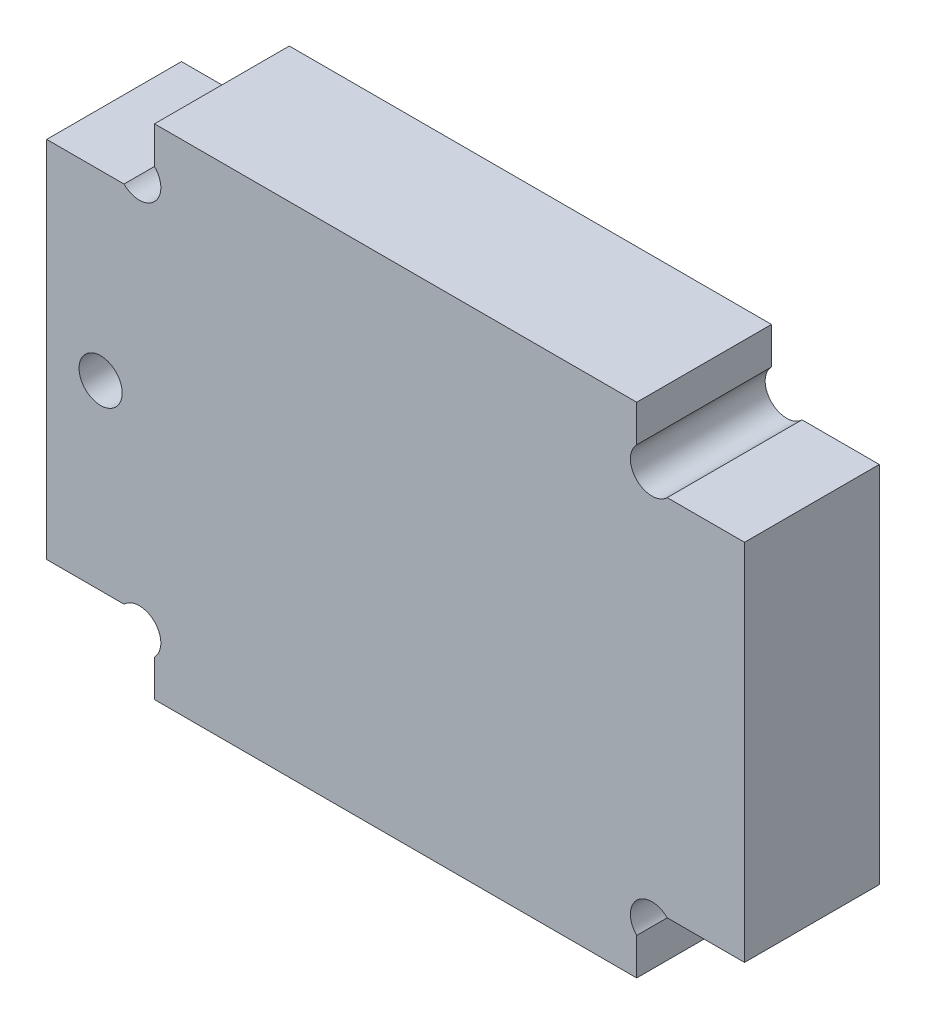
ISO-10303-21;
HEADER;
FILE_DESCRIPTION(('STEP AP214'),'2;1');
FILE_NAME('part.step','',(''),(''),'','','');
FILE_SCHEMA(('AUTOMOTIVE_DESIGN { 1 0 10303 214 1 1 1 1 }'));
ENDSEC;
DATA;
#1=APPLICATION_CONTEXT('core data for automotive mechanical design processes');
#2=APPLICATION_PROTOCOL_DEFINITION('international standard','automotive_design',2000,#1);
#3=PRODUCT_CONTEXT('',#1,'mechanical');
#4=PRODUCT('Part','Part','',(#3));
#5=PRODUCT_RELATED_PRODUCT_CATEGORY('part','',(#4));
#6=PRODUCT_DEFINITION_FORMATION('','',#4);
#7=PRODUCT_DEFINITION_CONTEXT('part definition',#1,'design');
#8=PRODUCT_DEFINITION('design','',#6,#7);
#9=PRODUCT_DEFINITION_SHAPE('','',#8);
#10=(LENGTH_UNIT() NAMED_UNIT(*) SI_UNIT(.MILLI.,.METRE.));
#11=(NAMED_UNIT(*) PLANE_ANGLE_UNIT() SI_UNIT($,.RADIAN.));
#12=(NAMED_UNIT(*) SI_UNIT($,.STERADIAN.) SOLID_ANGLE_UNIT());
#13=UNCERTAINTY_MEASURE_WITH_UNIT(LENGTH_MEASURE(1.E-05),#10,'distance_accuracy_value','');
#14=(GEOMETRIC_REPRESENTATION_CONTEXT(3) GLOBAL_UNCERTAINTY_ASSIGNED_CONTEXT((#13)) GLOBAL_UNIT_ASSIGNED_CONTEXT((#10,
#11,#12)) REPRESENTATION_CONTEXT('',''));
#15=CARTESIAN_POINT('',(0.,0.,0.));
#16=DIRECTION('',(0.,0.,1.));
#17=DIRECTION('',(1.,0.,0.));
#18=AXIS2_PLACEMENT_3D('',#15,#16,#17);
#19=CARTESIAN_POINT('',(-17.89,18.5,10.));
#20=DIRECTION('',(1.,0.,0.));
#21=DIRECTION('',(0.,1.,0.));
#22=AXIS2_PLACEMENT_3D('',#19,#20,#21);
#23=PLANE('',#22);
#24=DIRECTION('',(0.,-1.,0.));
#25=VECTOR('',#24,1.);
#26=CARTESIAN_POINT('',(-17.89,18.5,0.));
#27=LINE('',#26,#25);
#28=CARTESIAN_POINT('',(-17.89,18.5,0.));
#29=VERTEX_POINT('',#28);
#30=CARTESIAN_POINT('',(-17.89,15.762741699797,0.));
#31=VERTEX_POINT('',#30);
#32=EDGE_CURVE('E225',#29,#31,#27,.T.);
#33=ORIENTED_EDGE('',*,*,#32,.T.);
#34=DIRECTION('',(0.,0.,1.));
#35=VECTOR('',#34,1.);
#36=CARTESIAN_POINT('',(-17.89,15.762741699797,0.));
#37=LINE('',#36,#35);
#38=CARTESIAN_POINT('',(-17.89,15.762741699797,10.));
#39=VERTEX_POINT('',#38);
#40=EDGE_CURVE('E252',#31,#39,#37,.T.);
#41=ORIENTED_EDGE('',*,*,#40,.T.);
#42=DIRECTION('',(0.,-1.,0.));
#43=VECTOR('',#42,1.);
#44=CARTESIAN_POINT('',(-17.89,18.5,10.));
#45=LINE('',#44,#43);
#46=CARTESIAN_POINT('',(-17.89,18.5,10.));
#47=VERTEX_POINT('',#46);
#48=EDGE_CURVE('E231',#47,#39,#45,.T.);
#49=ORIENTED_EDGE('',*,*,#48,.F.);
#50=DIRECTION('',(0.,0.,-1.));
#51=VECTOR('',#50,1.);
#52=CARTESIAN_POINT('',(-17.89,18.5,10.));
#53=LINE('',#52,#51);
#54=EDGE_CURVE('E221',#47,#29,#53,.T.);
#55=ORIENTED_EDGE('',*,*,#54,.T.);
#56=EDGE_LOOP('',(#33,#41,#49,#55));
#57=FACE_BOUND('',#56,.T.);
#58=ADVANCED_FACE('F33',(#57),#23,.F.);
#59=CARTESIAN_POINT('',(-17.89,-15.762741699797,10.));
#60=VERTEX_POINT('',#59);
#61=CARTESIAN_POINT('',(-17.89,-18.5,10.));
#62=VERTEX_POINT('',#61);
#63=EDGE_CURVE('E36',#60,#62,#45,.T.);
#64=ORIENTED_EDGE('',*,*,#63,.F.);
#65=DIRECTION('',(0.,0.,1.));
#66=VECTOR('',#65,1.);
#67=CARTESIAN_POINT('',(-17.89,-15.762741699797,0.));
#68=LINE('',#67,#66);
#69=CARTESIAN_POINT('',(-17.89,-15.762741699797,0.));
#70=VERTEX_POINT('',#69);
#71=EDGE_CURVE('E154',#70,#60,#68,.T.);
#72=ORIENTED_EDGE('',*,*,#71,.F.);
#73=CARTESIAN_POINT('',(-17.89,-18.5,0.));
#74=VERTEX_POINT('',#73);
#75=EDGE_CURVE('E163',#70,#74,#27,.T.);
#76=ORIENTED_EDGE('',*,*,#75,.T.);
#77=DIRECTION('',(0.,0.,-1.));
#78=VECTOR('',#77,1.);
#79=CARTESIAN_POINT('',(-17.89,-18.5,10.));
#80=LINE('',#79,#78);
#81=EDGE_CURVE('E11',#62,#74,#80,.T.);
#82=ORIENTED_EDGE('',*,*,#81,.F.);
#83=EDGE_LOOP('',(#64,#72,#76,#82));
#84=FACE_BOUND('',#83,.T.);
#85=ADVANCED_FACE('F325',(#84),#23,.F.);
#86=CARTESIAN_POINT('',(17.89,18.5,10.));
#87=DIRECTION('',(1.,0.,0.));
#88=DIRECTION('',(0.,1.,0.));
#89=AXIS2_PLACEMENT_3D('',#86,#87,#88);
#90=PLANE('',#89);
#91=DIRECTION('',(0.,0.,1.));
#92=VECTOR('',#91,1.);
#93=CARTESIAN_POINT('',(17.89,15.762741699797,0.));
#94=LINE('',#93,#92);
#95=CARTESIAN_POINT('',(17.89,15.762741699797,0.));
#96=VERTEX_POINT('',#95);
#97=CARTESIAN_POINT('',(17.89,15.762741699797,10.));
#98=VERTEX_POINT('',#97);
#99=EDGE_CURVE('E518',#96,#98,#94,.T.);
#100=ORIENTED_EDGE('',*,*,#99,.F.);
#101=DIRECTION('',(0.,-1.,0.));
#102=VECTOR('',#101,1.);
#103=CARTESIAN_POINT('',(17.89,18.5,0.));
#104=LINE('',#103,#102);
#105=CARTESIAN_POINT('',(17.89,18.5,0.));
#106=VERTEX_POINT('',#105);
#107=EDGE_CURVE('E194',#106,#96,#104,.T.);
#108=ORIENTED_EDGE('',*,*,#107,.F.);
#109=DIRECTION('',(0.,0.,-1.));
#110=VECTOR('',#109,1.);
#111=CARTESIAN_POINT('',(17.89,18.5,10.));
#112=LINE('',#111,#110);
#113=CARTESIAN_POINT('',(17.89,18.5,10.));
#114=VERTEX_POINT('',#113);
#115=EDGE_CURVE('E278',#114,#106,#112,.T.);
#116=ORIENTED_EDGE('',*,*,#115,.F.);
#117=DIRECTION('',(0.,-1.,0.));
#118=VECTOR('',#117,1.);
#119=CARTESIAN_POINT('',(17.89,18.5,10.));
#120=LINE('',#119,#118);
#121=EDGE_CURVE('E209',#114,#98,#120,.T.);
#122=ORIENTED_EDGE('',*,*,#121,.T.);
#123=EDGE_LOOP('',(#100,#108,#116,#122));
#124=FACE_BOUND('',#123,.T.);
#125=ADVANCED_FACE('F348',(#124),#90,.T.);
#126=CARTESIAN_POINT('',(-17.89,-18.5,10.));
#127=DIRECTION('',(0.,1.,0.));
#128=DIRECTION('',(0.,0.,1.));
#129=AXIS2_PLACEMENT_3D('',#126,#127,#128);
#130=PLANE('',#129);
#131=DIRECTION('',(1.,0.,0.));
#132=VECTOR('',#131,1.);
#133=CARTESIAN_POINT('',(-17.89,-18.5,0.));
#134=LINE('',#133,#132);
#135=CARTESIAN_POINT('',(17.89,-18.5,0.));
#136=VERTEX_POINT('',#135);
#137=EDGE_CURVE('E195',#74,#136,#134,.T.);
#138=ORIENTED_EDGE('',*,*,#137,.T.);
#139=DIRECTION('',(0.,0.,-1.));
#140=VECTOR('',#139,1.);
#141=CARTESIAN_POINT('',(17.89,-18.5,10.));
#142=LINE('',#141,#140);
#143=CARTESIAN_POINT('',(17.89,-18.5,10.));
#144=VERTEX_POINT('',#143);
#145=EDGE_CURVE('E42',#144,#136,#142,.T.);
#146=ORIENTED_EDGE('',*,*,#145,.F.);
#147=DIRECTION('',(1.,0.,0.));
#148=VECTOR('',#147,1.);
#149=CARTESIAN_POINT('',(-17.89,-18.5,10.));
#150=LINE('',#149,#148);
#151=EDGE_CURVE('E218',#62,#144,#150,.T.);
#152=ORIENTED_EDGE('',*,*,#151,.F.);
#153=ORIENTED_EDGE('',*,*,#81,.T.);
#154=EDGE_LOOP('',(#138,#146,#152,#153));
#155=FACE_BOUND('',#154,.T.);
#156=ADVANCED_FACE('F293',(#155),#130,.F.);
#157=DIRECTION('',(0.,0.,1.));
#158=VECTOR('',#157,1.);
#159=CARTESIAN_POINT('',(17.89,-15.762741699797,0.));
#160=LINE('',#159,#158);
#161=CARTESIAN_POINT('',(17.89,-15.762741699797,0.));
#162=VERTEX_POINT('',#161);
#163=CARTESIAN_POINT('',(17.89,-15.762741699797,10.));
#164=VERTEX_POINT('',#163);
#165=EDGE_CURVE('E298',#162,#164,#160,.T.);
#166=ORIENTED_EDGE('',*,*,#165,.T.);
#167=EDGE_CURVE('E196',#164,#144,#120,.T.);
#168=ORIENTED_EDGE('',*,*,#167,.T.);
#169=ORIENTED_EDGE('',*,*,#145,.T.);
#170=EDGE_CURVE('E191',#162,#136,#104,.T.);
#171=ORIENTED_EDGE('',*,*,#170,.F.);
#172=EDGE_LOOP('',(#166,#168,#169,#171));
#173=FACE_BOUND('',#172,.T.);
#174=ADVANCED_FACE('F288',(#173),#90,.T.);
#175=CARTESIAN_POINT('',(-17.89,18.5,10.));
#176=DIRECTION('',(0.,1.,0.));
#177=DIRECTION('',(0.,0.,1.));
#178=AXIS2_PLACEMENT_3D('',#175,#176,#177);
#179=PLANE('',#178);
#180=DIRECTION('',(1.,0.,0.));
#181=VECTOR('',#180,1.);
#182=CARTESIAN_POINT('',(-17.89,18.5,0.));
#183=LINE('',#182,#181);
#184=EDGE_CURVE('E202',#29,#106,#183,.T.);
#185=ORIENTED_EDGE('',*,*,#184,.F.);
#186=ORIENTED_EDGE('',*,*,#54,.F.);
#187=DIRECTION('',(1.,0.,0.));
#188=VECTOR('',#187,1.);
#189=CARTESIAN_POINT('',(-17.89,18.5,10.));
#190=LINE('',#189,#188);
#191=EDGE_CURVE('E212',#47,#114,#190,.T.);
#192=ORIENTED_EDGE('',*,*,#191,.T.);
#193=ORIENTED_EDGE('',*,*,#115,.T.);
#194=EDGE_LOOP('',(#185,#186,#192,#193));
#195=FACE_BOUND('',#194,.T.);
#196=ADVANCED_FACE('F277',(#195),#179,.T.);
#197=CARTESIAN_POINT('',(0.,0.,10.));
#198=DIRECTION('',(0.,0.,1.));
#199=DIRECTION('',(1.,0.,0.));
#200=AXIS2_PLACEMENT_3D('',#197,#198,#199);
#201=PLANE('',#200);
#202=CARTESIAN_POINT('',(-21.89,0.,10.));
#203=DIRECTION('',(0.,0.,1.));
#204=DIRECTION('',(1.,0.,0.));
#205=AXIS2_PLACEMENT_3D('',#202,#203,#204);
#206=CIRCLE('',#205,1.6);
#207=CARTESIAN_POINT('',(-20.29,0.,10.));
#208=VERTEX_POINT('',#207);
#209=EDGE_CURVE('E317',#208,#208,#206,.T.);
#210=ORIENTED_EDGE('',*,*,#209,.F.);
#211=EDGE_LOOP('',(#210));
#212=FACE_BOUND('',#211,.T.);
#213=DIRECTION('',(1.,0.,0.));
#214=VECTOR('',#213,1.);
#215=CARTESIAN_POINT('',(-25.89,-13.5,10.));
#216=LINE('',#215,#214);
#217=CARTESIAN_POINT('',(-25.89,-13.5,10.));
#218=VERTEX_POINT('',#217);
#219=CARTESIAN_POINT('',(-20.1527416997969,-13.5,10.));
#220=VERTEX_POINT('',#219);
#221=EDGE_CURVE('E169',#218,#220,#216,.T.);
#222=ORIENTED_EDGE('',*,*,#221,.T.);
#223=CARTESIAN_POINT('',(-19.0213708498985,-14.6313708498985,10.));
#224=DIRECTION('',(0.,0.,1.));
#225=DIRECTION('',(1.,0.,0.));
#226=AXIS2_PLACEMENT_3D('',#223,#224,#225);
#227=CIRCLE('',#226,1.6);
#228=EDGE_CURVE('E50',#60,#220,#227,.T.);
#229=ORIENTED_EDGE('',*,*,#228,.F.);
#230=ORIENTED_EDGE('',*,*,#63,.T.);
#231=ORIENTED_EDGE('',*,*,#151,.T.);
#232=ORIENTED_EDGE('',*,*,#167,.F.);
#233=CARTESIAN_POINT('',(19.0213708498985,-14.6313708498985,10.));
#234=DIRECTION('',(0.,0.,1.));
#235=DIRECTION('',(-1.,0.,0.));
#236=AXIS2_PLACEMENT_3D('',#233,#234,#235);
#237=CIRCLE('',#236,1.59999999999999);
#238=CARTESIAN_POINT('',(20.1527416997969,-13.5,10.));
#239=VERTEX_POINT('',#238);
#240=EDGE_CURVE('E299',#239,#164,#237,.T.);
#241=ORIENTED_EDGE('',*,*,#240,.F.);
#242=DIRECTION('',(-1.,0.,0.));
#243=VECTOR('',#242,1.);
#244=CARTESIAN_POINT('',(25.89,-13.5,10.));
#245=LINE('',#244,#243);
#246=CARTESIAN_POINT('',(25.89,-13.5,10.));
#247=VERTEX_POINT('',#246);
#248=EDGE_CURVE('E534',#247,#239,#245,.T.);
#249=ORIENTED_EDGE('',*,*,#248,.F.);
#250=DIRECTION('',(0.,-1.,0.));
#251=VECTOR('',#250,1.);
#252=CARTESIAN_POINT('',(25.89,13.5,10.));
#253=LINE('',#252,#251);
#254=CARTESIAN_POINT('',(25.89,13.5,10.));
#255=VERTEX_POINT('',#254);
#256=EDGE_CURVE('E168',#255,#247,#253,.T.);
#257=ORIENTED_EDGE('',*,*,#256,.F.);
#258=DIRECTION('',(-1.,0.,0.));
#259=VECTOR('',#258,1.);
#260=CARTESIAN_POINT('',(25.89,13.5,10.));
#261=LINE('',#260,#259);
#262=CARTESIAN_POINT('',(20.1527416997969,13.5,10.));
#263=VERTEX_POINT('',#262);
#264=EDGE_CURVE('E238',#255,#263,#261,.T.);
#265=ORIENTED_EDGE('',*,*,#264,.T.);
#266=CARTESIAN_POINT('',(19.0213708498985,14.6313708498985,10.));
#267=DIRECTION('',(0.,0.,1.));
#268=DIRECTION('',(1.,0.,0.));
#269=AXIS2_PLACEMENT_3D('',#266,#267,#268);
#270=CIRCLE('',#269,1.6);
#271=EDGE_CURVE('E305',#98,#263,#270,.T.);
#272=ORIENTED_EDGE('',*,*,#271,.F.);
#273=ORIENTED_EDGE('',*,*,#121,.F.);
#274=ORIENTED_EDGE('',*,*,#191,.F.);
#275=ORIENTED_EDGE('',*,*,#48,.T.);
#276=CARTESIAN_POINT('',(-19.0213708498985,14.6313708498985,10.));
#277=DIRECTION('',(0.,0.,1.));
#278=DIRECTION('',(-1.,0.,0.));
#279=AXIS2_PLACEMENT_3D('',#276,#277,#278);
#280=CIRCLE('',#279,1.6);
#281=CARTESIAN_POINT('',(-20.1527416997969,13.5,10.));
#282=VERTEX_POINT('',#281);
#283=EDGE_CURVE('E253',#282,#39,#280,.T.);
#284=ORIENTED_EDGE('',*,*,#283,.F.);
#285=DIRECTION('',(1.,0.,0.));
#286=VECTOR('',#285,1.);
#287=CARTESIAN_POINT('',(-25.89,13.5,10.));
#288=LINE('',#287,#286);
#289=CARTESIAN_POINT('',(-25.89,13.5,10.));
#290=VERTEX_POINT('',#289);
#291=EDGE_CURVE('E174',#290,#282,#288,.T.);
#292=ORIENTED_EDGE('',*,*,#291,.F.);
#293=DIRECTION('',(0.,1.,0.));
#294=VECTOR('',#293,1.);
#295=CARTESIAN_POINT('',(-25.89,13.5,10.));
#296=LINE('',#295,#294);
#297=EDGE_CURVE('E243',#218,#290,#296,.T.);
#298=ORIENTED_EDGE('',*,*,#297,.F.);
#299=EDGE_LOOP('',(#222,#229,#230,#231,#232,#241,#249,#257,#265,#272,#273,#274,#275,#284,#292,#298));
#300=FACE_BOUND('',#299,.T.);
#301=ADVANCED_FACE('F272',(#212,#300),#201,.T.);
#302=CARTESIAN_POINT('',(0.,0.,0.));
#303=DIRECTION('',(0.,0.,1.));
#304=DIRECTION('',(1.,0.,0.));
#305=AXIS2_PLACEMENT_3D('',#302,#303,#304);
#306=PLANE('',#305);
#307=CARTESIAN_POINT('',(-21.89,0.,0.));
#308=DIRECTION('',(0.,0.,1.));
#309=DIRECTION('',(1.,0.,0.));
#310=AXIS2_PLACEMENT_3D('',#307,#308,#309);
#311=CIRCLE('',#310,1.6);
#312=CARTESIAN_POINT('',(-20.29,0.,0.));
#313=VERTEX_POINT('',#312);
#314=EDGE_CURVE('E324',#313,#313,#311,.T.);
#315=ORIENTED_EDGE('',*,*,#314,.T.);
#316=EDGE_LOOP('',(#315));
#317=FACE_BOUND('',#316,.T.);
#318=ORIENTED_EDGE('',*,*,#75,.F.);
#319=CARTESIAN_POINT('',(-19.0213708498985,-14.6313708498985,0.));
#320=DIRECTION('',(0.,0.,1.));
#321=DIRECTION('',(1.,0.,0.));
#322=AXIS2_PLACEMENT_3D('',#319,#320,#321);
#323=CIRCLE('',#322,1.6);
#324=CARTESIAN_POINT('',(-20.1527416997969,-13.5,0.));
#325=VERTEX_POINT('',#324);
#326=EDGE_CURVE('E148',#70,#325,#323,.T.);
#327=ORIENTED_EDGE('',*,*,#326,.T.);
#328=DIRECTION('',(1.,0.,0.));
#329=VECTOR('',#328,1.);
#330=CARTESIAN_POINT('',(-25.89,-13.5,0.));
#331=LINE('',#330,#329);
#332=CARTESIAN_POINT('',(-25.89,-13.5,0.));
#333=VERTEX_POINT('',#332);
#334=EDGE_CURVE('E161',#333,#325,#331,.T.);
#335=ORIENTED_EDGE('',*,*,#334,.F.);
#336=DIRECTION('',(0.,-1.,0.));
#337=VECTOR('',#336,1.);
#338=CARTESIAN_POINT('',(-25.89,13.5,0.));
#339=LINE('',#338,#337);
#340=CARTESIAN_POINT('',(-25.89,13.5,0.));
#341=VERTEX_POINT('',#340);
#342=EDGE_CURVE('E246',#341,#333,#339,.T.);
#343=ORIENTED_EDGE('',*,*,#342,.F.);
#344=DIRECTION('',(1.,0.,0.));
#345=VECTOR('',#344,1.);
#346=CARTESIAN_POINT('',(-25.89,13.5,0.));
#347=LINE('',#346,#345);
#348=CARTESIAN_POINT('',(-20.1527416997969,13.5,0.));
#349=VERTEX_POINT('',#348);
#350=EDGE_CURVE('E181',#341,#349,#347,.T.);
#351=ORIENTED_EDGE('',*,*,#350,.T.);
#352=CARTESIAN_POINT('',(-19.0213708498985,14.6313708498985,0.));
#353=DIRECTION('',(0.,0.,1.));
#354=DIRECTION('',(-1.,0.,0.));
#355=AXIS2_PLACEMENT_3D('',#352,#353,#354);
#356=CIRCLE('',#355,1.6);
#357=EDGE_CURVE('E249',#349,#31,#356,.T.);
#358=ORIENTED_EDGE('',*,*,#357,.T.);
#359=ORIENTED_EDGE('',*,*,#32,.F.);
#360=ORIENTED_EDGE('',*,*,#184,.T.);
#361=ORIENTED_EDGE('',*,*,#107,.T.);
#362=CARTESIAN_POINT('',(19.0213708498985,14.6313708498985,0.));
#363=DIRECTION('',(0.,0.,1.));
#364=DIRECTION('',(1.,0.,0.));
#365=AXIS2_PLACEMENT_3D('',#362,#363,#364);
#366=CIRCLE('',#365,1.6);
#367=CARTESIAN_POINT('',(20.1527416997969,13.5,0.));
#368=VERTEX_POINT('',#367);
#369=EDGE_CURVE('E258',#96,#368,#366,.T.);
#370=ORIENTED_EDGE('',*,*,#369,.T.);
#371=DIRECTION('',(-1.,0.,0.));
#372=VECTOR('',#371,1.);
#373=CARTESIAN_POINT('',(25.89,13.5,0.));
#374=LINE('',#373,#372);
#375=CARTESIAN_POINT('',(25.89,13.5,0.));
#376=VERTEX_POINT('',#375);
#377=EDGE_CURVE('E525',#376,#368,#374,.T.);
#378=ORIENTED_EDGE('',*,*,#377,.F.);
#379=DIRECTION('',(0.,1.,0.));
#380=VECTOR('',#379,1.);
#381=CARTESIAN_POINT('',(25.89,13.5,0.));
#382=LINE('',#381,#380);
#383=CARTESIAN_POINT('',(25.89,-13.5,0.));
#384=VERTEX_POINT('',#383);
#385=EDGE_CURVE('E239',#384,#376,#382,.T.);
#386=ORIENTED_EDGE('',*,*,#385,.F.);
#387=DIRECTION('',(-1.,0.,0.));
#388=VECTOR('',#387,1.);
#389=CARTESIAN_POINT('',(25.89,-13.5,0.));
#390=LINE('',#389,#388);
#391=CARTESIAN_POINT('',(20.1527416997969,-13.5,0.));
#392=VERTEX_POINT('',#391);
#393=EDGE_CURVE('E213',#384,#392,#390,.T.);
#394=ORIENTED_EDGE('',*,*,#393,.T.);
#395=CARTESIAN_POINT('',(19.0213708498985,-14.6313708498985,0.));
#396=DIRECTION('',(0.,0.,1.));
#397=DIRECTION('',(-1.,0.,0.));
#398=AXIS2_PLACEMENT_3D('',#395,#396,#397);
#399=CIRCLE('',#398,1.59999999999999);
#400=EDGE_CURVE('E58',#392,#162,#399,.T.);
#401=ORIENTED_EDGE('',*,*,#400,.T.);
#402=ORIENTED_EDGE('',*,*,#170,.T.);
#403=ORIENTED_EDGE('',*,*,#137,.F.);
#404=EDGE_LOOP('',(#318,#327,#335,#343,#351,#358,#359,#360,#361,#370,#378,#386,#394,#401,#402,#403));
#405=FACE_BOUND('',#404,.T.);
#406=ADVANCED_FACE('F159',(#317,#405),#306,.F.);
#407=CARTESIAN_POINT('',(25.89,-13.5,10.));
#408=DIRECTION('',(0.,1.,0.));
#409=DIRECTION('',(0.,0.,1.));
#410=AXIS2_PLACEMENT_3D('',#407,#408,#409);
#411=PLANE('',#410);
#412=ORIENTED_EDGE('',*,*,#248,.T.);
#413=DIRECTION('',(0.,0.,1.));
#414=VECTOR('',#413,1.);
#415=CARTESIAN_POINT('',(20.1527416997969,-13.5,0.));
#416=LINE('',#415,#414);
#417=EDGE_CURVE('E303',#392,#239,#416,.T.);
#418=ORIENTED_EDGE('',*,*,#417,.F.);
#419=ORIENTED_EDGE('',*,*,#393,.F.);
#420=DIRECTION('',(0.,0.,-1.));
#421=VECTOR('',#420,1.);
#422=CARTESIAN_POINT('',(25.89,-13.5,10.));
#423=LINE('',#422,#421);
#424=EDGE_CURVE('E172',#247,#384,#423,.T.);
#425=ORIENTED_EDGE('',*,*,#424,.F.);
#426=EDGE_LOOP('',(#412,#418,#419,#425));
#427=FACE_BOUND('',#426,.T.);
#428=ADVANCED_FACE('F371',(#427),#411,.F.);
#429=CARTESIAN_POINT('',(25.89,13.5,10.));
#430=DIRECTION('',(0.,-1.,0.));
#431=DIRECTION('',(1.,0.,0.));
#432=AXIS2_PLACEMENT_3D('',#429,#430,#431);
#433=PLANE('',#432);
#434=ORIENTED_EDGE('',*,*,#377,.T.);
#435=DIRECTION('',(0.,0.,1.));
#436=VECTOR('',#435,1.);
#437=CARTESIAN_POINT('',(20.1527416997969,13.5,0.));
#438=LINE('',#437,#436);
#439=EDGE_CURVE('E517',#368,#263,#438,.T.);
#440=ORIENTED_EDGE('',*,*,#439,.T.);
#441=ORIENTED_EDGE('',*,*,#264,.F.);
#442=DIRECTION('',(0.,0.,1.));
#443=VECTOR('',#442,1.);
#444=CARTESIAN_POINT('',(25.89,13.5,10.));
#445=LINE('',#444,#443);
#446=EDGE_CURVE('E235',#376,#255,#445,.T.);
#447=ORIENTED_EDGE('',*,*,#446,.F.);
#448=EDGE_LOOP('',(#434,#440,#441,#447));
#449=FACE_BOUND('',#448,.T.);
#450=ADVANCED_FACE('F376',(#449),#433,.F.);
#451=CARTESIAN_POINT('',(25.89,0.,0.));
#452=DIRECTION('',(1.,0.,0.));
#453=DIRECTION('',(0.,1.,0.));
#454=AXIS2_PLACEMENT_3D('',#451,#452,#453);
#455=PLANE('',#454);
#456=ORIENTED_EDGE('',*,*,#256,.T.);
#457=ORIENTED_EDGE('',*,*,#424,.T.);
#458=ORIENTED_EDGE('',*,*,#385,.T.);
#459=ORIENTED_EDGE('',*,*,#446,.T.);
#460=EDGE_LOOP('',(#456,#457,#458,#459));
#461=FACE_BOUND('',#460,.T.);
#462=ADVANCED_FACE('F380',(#461),#455,.T.);
#463=CARTESIAN_POINT('',(-25.89,-13.5,0.));
#464=DIRECTION('',(0.,1.,0.));
#465=DIRECTION('',(0.,0.,1.));
#466=AXIS2_PLACEMENT_3D('',#463,#464,#465);
#467=PLANE('',#466);
#468=ORIENTED_EDGE('',*,*,#334,.T.);
#469=DIRECTION('',(0.,0.,1.));
#470=VECTOR('',#469,1.);
#471=CARTESIAN_POINT('',(-20.1527416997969,-13.5,0.));
#472=LINE('',#471,#470);
#473=EDGE_CURVE('E145',#325,#220,#472,.T.);
#474=ORIENTED_EDGE('',*,*,#473,.T.);
#475=ORIENTED_EDGE('',*,*,#221,.F.);
#476=DIRECTION('',(0.,0.,1.));
#477=VECTOR('',#476,1.);
#478=CARTESIAN_POINT('',(-25.89,-13.5,0.));
#479=LINE('',#478,#477);
#480=EDGE_CURVE('E166',#333,#218,#479,.T.);
#481=ORIENTED_EDGE('',*,*,#480,.F.);
#482=EDGE_LOOP('',(#468,#474,#475,#481));
#483=FACE_BOUND('',#482,.T.);
#484=ADVANCED_FACE('F165',(#483),#467,.F.);
#485=CARTESIAN_POINT('',(-25.89,13.5,0.));
#486=DIRECTION('',(0.,-1.,0.));
#487=DIRECTION('',(0.,0.,-1.));
#488=AXIS2_PLACEMENT_3D('',#485,#486,#487);
#489=PLANE('',#488);
#490=ORIENTED_EDGE('',*,*,#291,.T.);
#491=DIRECTION('',(0.,0.,1.));
#492=VECTOR('',#491,1.);
#493=CARTESIAN_POINT('',(-20.1527416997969,13.5,0.));
#494=LINE('',#493,#492);
#495=EDGE_CURVE('E248',#349,#282,#494,.T.);
#496=ORIENTED_EDGE('',*,*,#495,.F.);
#497=ORIENTED_EDGE('',*,*,#350,.F.);
#498=DIRECTION('',(0.,0.,-1.));
#499=VECTOR('',#498,1.);
#500=CARTESIAN_POINT('',(-25.89,13.5,0.));
#501=LINE('',#500,#499);
#502=EDGE_CURVE('E184',#290,#341,#501,.T.);
#503=ORIENTED_EDGE('',*,*,#502,.F.);
#504=EDGE_LOOP('',(#490,#496,#497,#503));
#505=FACE_BOUND('',#504,.T.);
#506=ADVANCED_FACE('F331',(#505),#489,.F.);
#507=CARTESIAN_POINT('',(-25.89,0.,0.));
#508=DIRECTION('',(-1.,0.,0.));
#509=DIRECTION('',(0.,-1.,0.));
#510=AXIS2_PLACEMENT_3D('',#507,#508,#509);
#511=PLANE('',#510);
#512=ORIENTED_EDGE('',*,*,#342,.T.);
#513=ORIENTED_EDGE('',*,*,#480,.T.);
#514=ORIENTED_EDGE('',*,*,#297,.T.);
#515=ORIENTED_EDGE('',*,*,#502,.T.);
#516=EDGE_LOOP('',(#512,#513,#514,#515));
#517=FACE_BOUND('',#516,.T.);
#518=ADVANCED_FACE('F334',(#517),#511,.T.);
#519=CARTESIAN_POINT('',(-19.0213708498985,14.6313708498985,0.));
#520=DIRECTION('',(0.,0.,1.));
#521=DIRECTION('',(1.,0.,0.));
#522=AXIS2_PLACEMENT_3D('',#519,#520,#521);
#523=CYLINDRICAL_SURFACE('',#522,1.6);
#524=ORIENTED_EDGE('',*,*,#357,.F.);
#525=ORIENTED_EDGE('',*,*,#495,.T.);
#526=ORIENTED_EDGE('',*,*,#283,.T.);
#527=ORIENTED_EDGE('',*,*,#40,.F.);
#528=EDGE_LOOP('',(#524,#525,#526,#527));
#529=FACE_BOUND('',#528,.T.);
#530=ADVANCED_FACE('F329',(#529),#523,.F.);
#531=CARTESIAN_POINT('',(19.0213708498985,14.6313708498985,0.));
#532=DIRECTION('',(0.,0.,1.));
#533=DIRECTION('',(1.,0.,0.));
#534=AXIS2_PLACEMENT_3D('',#531,#532,#533);
#535=CYLINDRICAL_SURFACE('',#534,1.6);
#536=ORIENTED_EDGE('',*,*,#271,.T.);
#537=ORIENTED_EDGE('',*,*,#439,.F.);
#538=ORIENTED_EDGE('',*,*,#369,.F.);
#539=ORIENTED_EDGE('',*,*,#99,.T.);
#540=EDGE_LOOP('',(#536,#537,#538,#539));
#541=FACE_BOUND('',#540,.T.);
#542=ADVANCED_FACE('F341',(#541),#535,.F.);
#543=CARTESIAN_POINT('',(19.0213708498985,-14.6313708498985,0.));
#544=DIRECTION('',(0.,0.,1.));
#545=DIRECTION('',(1.,0.,0.));
#546=AXIS2_PLACEMENT_3D('',#543,#544,#545);
#547=CYLINDRICAL_SURFACE('',#546,1.59999999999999);
#548=ORIENTED_EDGE('',*,*,#400,.F.);
#549=ORIENTED_EDGE('',*,*,#417,.T.);
#550=ORIENTED_EDGE('',*,*,#240,.T.);
#551=ORIENTED_EDGE('',*,*,#165,.F.);
#552=EDGE_LOOP('',(#548,#549,#550,#551));
#553=FACE_BOUND('',#552,.T.);
#554=ADVANCED_FACE('F301',(#553),#547,.F.);
#555=CARTESIAN_POINT('',(-19.0213708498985,-14.6313708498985,0.));
#556=DIRECTION('',(0.,0.,1.));
#557=DIRECTION('',(1.,0.,0.));
#558=AXIS2_PLACEMENT_3D('',#555,#556,#557);
#559=CYLINDRICAL_SURFACE('',#558,1.6);
#560=ORIENTED_EDGE('',*,*,#228,.T.);
#561=ORIENTED_EDGE('',*,*,#473,.F.);
#562=ORIENTED_EDGE('',*,*,#326,.F.);
#563=ORIENTED_EDGE('',*,*,#71,.T.);
#564=EDGE_LOOP('',(#560,#561,#562,#563));
#565=FACE_BOUND('',#564,.T.);
#566=ADVANCED_FACE('F147',(#565),#559,.F.);
#567=CARTESIAN_POINT('',(-21.89,0.,0.));
#568=DIRECTION('',(0.,0.,1.));
#569=DIRECTION('',(1.,0.,0.));
#570=AXIS2_PLACEMENT_3D('',#567,#568,#569);
#571=CYLINDRICAL_SURFACE('',#570,1.6);
#572=ORIENTED_EDGE('',*,*,#314,.F.);
#573=EDGE_LOOP('',(#572));
#574=FACE_BOUND('',#573,.T.);
#575=ORIENTED_EDGE('',*,*,#209,.T.);
#576=EDGE_LOOP('',(#575));
#577=FACE_BOUND('',#576,.T.);
#578=ADVANCED_FACE('F427',(#574,#577),#571,.F.);
#579=CLOSED_SHELL('',(#58,#85,#125,#156,#174,#196,#301,#406,#428,#450,#462,#484,#506,#518,#530,
#542,#554,#566,#578));
#580=MANIFOLD_SOLID_BREP('B2',#579);
#581=ADVANCED_BREP_SHAPE_REPRESENTATION('',(#18,#580),#14);
#582=SHAPE_DEFINITION_REPRESENTATION(#9,#581);
ENDSEC;
END-ISO-10303-21;
